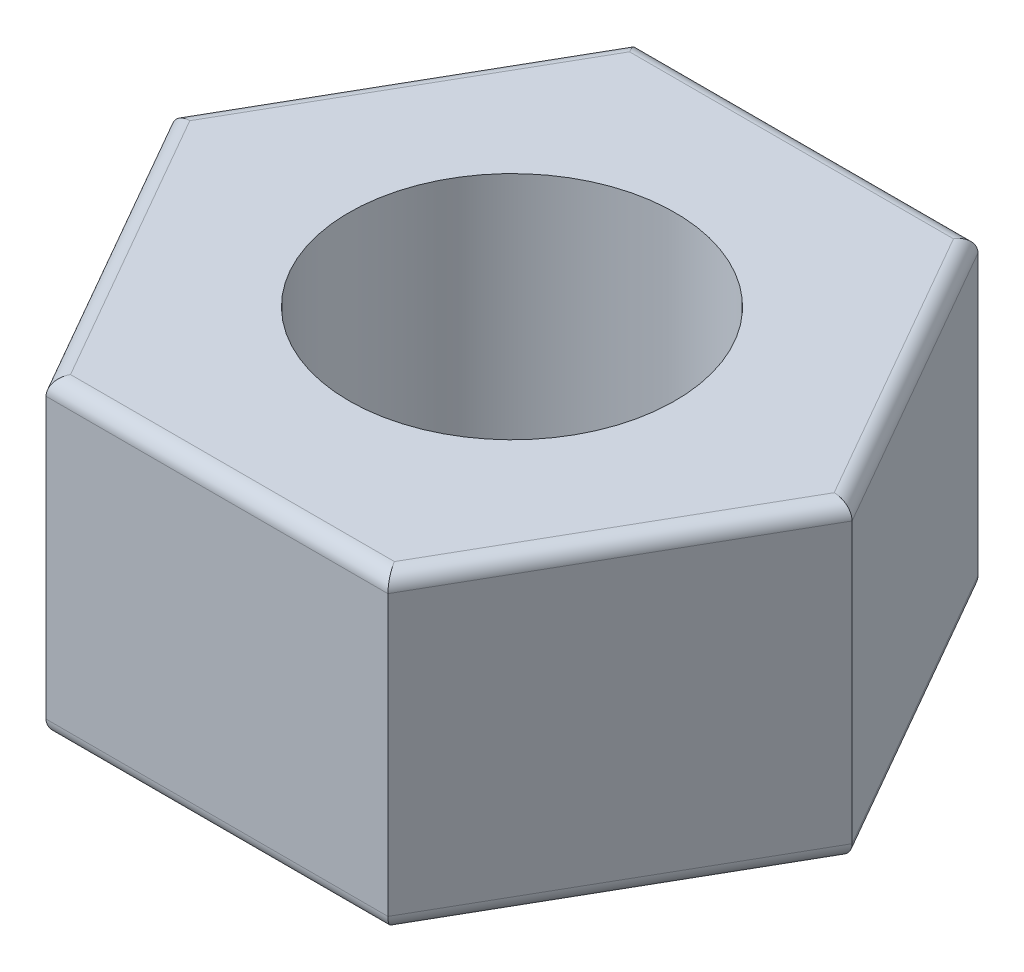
ISO-10303-21;
HEADER;
FILE_DESCRIPTION(('STEP AP214'),'2;1');
FILE_NAME('part.step','',(''),(''),'','','');
FILE_SCHEMA(('AUTOMOTIVE_DESIGN { 1 0 10303 214 1 1 1 1 }'));
ENDSEC;
DATA;
#1=APPLICATION_CONTEXT('core data for automotive mechanical design processes');
#2=APPLICATION_PROTOCOL_DEFINITION('international standard','automotive_design',2000,#1);
#3=PRODUCT_CONTEXT('',#1,'mechanical');
#4=PRODUCT('Part','Part','',(#3));
#5=PRODUCT_RELATED_PRODUCT_CATEGORY('part','',(#4));
#6=PRODUCT_DEFINITION_FORMATION('','',#4);
#7=PRODUCT_DEFINITION_CONTEXT('part definition',#1,'design');
#8=PRODUCT_DEFINITION('design','',#6,#7);
#9=PRODUCT_DEFINITION_SHAPE('','',#8);
#10=(LENGTH_UNIT() NAMED_UNIT(*) SI_UNIT(.MILLI.,.METRE.));
#11=(NAMED_UNIT(*) PLANE_ANGLE_UNIT() SI_UNIT($,.RADIAN.));
#12=(NAMED_UNIT(*) SI_UNIT($,.STERADIAN.) SOLID_ANGLE_UNIT());
#13=UNCERTAINTY_MEASURE_WITH_UNIT(LENGTH_MEASURE(1.E-05),#10,'distance_accuracy_value','');
#14=(GEOMETRIC_REPRESENTATION_CONTEXT(3) GLOBAL_UNCERTAINTY_ASSIGNED_CONTEXT((#13)) GLOBAL_UNIT_ASSIGNED_CONTEXT((#10,
#11,#12)) REPRESENTATION_CONTEXT('',''));
#15=CARTESIAN_POINT('',(0.,0.,0.));
#16=DIRECTION('',(0.,0.,1.));
#17=DIRECTION('',(1.,0.,0.));
#18=AXIS2_PLACEMENT_3D('',#15,#16,#17);
#19=CARTESIAN_POINT('',(5.50458908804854,10.,9.5));
#20=DIRECTION('',(0.,1.,0.));
#21=DIRECTION('',(0.,0.,1.));
#22=AXIS2_PLACEMENT_3D('',#19,#20,#21);
#23=PLANE('',#22);
#24=DIRECTION('',(-0.497297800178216,0.,0.867579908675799));
#25=VECTOR('',#24,1.);
#26=CARTESIAN_POINT('',(-10.5162100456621,10.,0.248648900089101));
#27=LINE('',#26,#25);
#28=CARTESIAN_POINT('',(-5.21487387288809,10.,-9.));
#29=VERTEX_POINT('',#28);
#30=CARTESIAN_POINT('',(-10.3736842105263,10.,0.));
#31=VERTEX_POINT('',#30);
#32=EDGE_CURVE('E38',#29,#31,#27,.T.);
#33=ORIENTED_EDGE('',*,*,#32,.T.);
#34=DIRECTION('',(0.497297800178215,0.,0.867579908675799));
#35=VECTOR('',#34,1.);
#36=CARTESIAN_POINT('',(-5.07079913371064,10.,9.25135109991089));
#37=LINE('',#36,#35);
#38=CARTESIAN_POINT('',(-5.21487387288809,10.,9.));
#39=VERTEX_POINT('',#38);
#40=EDGE_CURVE('E11',#31,#39,#37,.T.);
#41=ORIENTED_EDGE('',*,*,#40,.T.);
#42=DIRECTION('',(1.,0.,0.));
#43=VECTOR('',#42,1.);
#44=CARTESIAN_POINT('',(5.50458908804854,10.,9.));
#45=LINE('',#44,#43);
#46=CARTESIAN_POINT('',(5.21487387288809,10.,9.));
#47=VERTEX_POINT('',#46);
#48=EDGE_CURVE('E152',#39,#47,#45,.T.);
#49=ORIENTED_EDGE('',*,*,#48,.T.);
#50=DIRECTION('',(0.497297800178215,0.,-0.867579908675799));
#51=VECTOR('',#50,1.);
#52=CARTESIAN_POINT('',(10.5162100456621,10.,-0.248648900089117));
#53=LINE('',#52,#51);
#54=CARTESIAN_POINT('',(10.3736842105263,10.,0.));
#55=VERTEX_POINT('',#54);
#56=EDGE_CURVE('E230',#47,#55,#53,.T.);
#57=ORIENTED_EDGE('',*,*,#56,.T.);
#58=DIRECTION('',(-0.497297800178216,0.,-0.867579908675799));
#59=VECTOR('',#58,1.);
#60=CARTESIAN_POINT('',(5.07079913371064,10.,-9.25135109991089));
#61=LINE('',#60,#59);
#62=CARTESIAN_POINT('',(5.21487387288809,10.,-9.));
#63=VERTEX_POINT('',#62);
#64=EDGE_CURVE('E232',#55,#63,#61,.T.);
#65=ORIENTED_EDGE('',*,*,#64,.T.);
#66=DIRECTION('',(-1.,0.,0.));
#67=VECTOR('',#66,1.);
#68=CARTESIAN_POINT('',(-5.50458908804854,10.,-9.));
#69=LINE('',#68,#67);
#70=EDGE_CURVE('E48',#63,#29,#69,.T.);
#71=ORIENTED_EDGE('',*,*,#70,.T.);
#72=EDGE_LOOP('',(#33,#41,#49,#57,#65,#71));
#73=FACE_BOUND('',#72,.T.);
#74=CARTESIAN_POINT('',(0.,10.,0.));
#75=DIRECTION('',(0.,1.,0.));
#76=DIRECTION('',(0.,0.,1.));
#77=AXIS2_PLACEMENT_3D('',#74,#75,#76);
#78=CIRCLE('',#77,5.25);
#79=CARTESIAN_POINT('',(0.,10.,5.25));
#80=VERTEX_POINT('',#79);
#81=EDGE_CURVE('E141',#80,#80,#78,.T.);
#82=ORIENTED_EDGE('',*,*,#81,.F.);
#83=EDGE_LOOP('',(#82));
#84=FACE_BOUND('',#83,.T.);
#85=ADVANCED_FACE('F30',(#73,#84),#23,.T.);
#86=CARTESIAN_POINT('',(5.50458908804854,0.,9.5));
#87=DIRECTION('',(0.,1.,0.));
#88=DIRECTION('',(0.,0.,1.));
#89=AXIS2_PLACEMENT_3D('',#86,#87,#88);
#90=PLANE('',#89);
#91=DIRECTION('',(1.,0.,0.));
#92=VECTOR('',#91,1.);
#93=CARTESIAN_POINT('',(5.50458908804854,0.,9.));
#94=LINE('',#93,#92);
#95=CARTESIAN_POINT('',(5.21487387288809,0.,9.));
#96=VERTEX_POINT('',#95);
#97=CARTESIAN_POINT('',(-5.21487387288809,0.,9.));
#98=VERTEX_POINT('',#97);
#99=EDGE_CURVE('E200',#96,#98,#94,.F.);
#100=ORIENTED_EDGE('',*,*,#99,.T.);
#101=DIRECTION('',(0.497297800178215,0.,0.867579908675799));
#102=VECTOR('',#101,1.);
#103=CARTESIAN_POINT('',(-2.3481732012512,0.,14.0012123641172));
#104=LINE('',#103,#102);
#105=CARTESIAN_POINT('',(-10.3736842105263,0.,0.));
#106=VERTEX_POINT('',#105);
#107=EDGE_CURVE('E210',#98,#106,#104,.F.);
#108=ORIENTED_EDGE('',*,*,#107,.T.);
#109=DIRECTION('',(-0.497297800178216,0.,0.867579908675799));
#110=VECTOR('',#109,1.);
#111=CARTESIAN_POINT('',(-10.5456392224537,0.,0.299990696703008));
#112=LINE('',#111,#110);
#113=CARTESIAN_POINT('',(-5.21487387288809,0.,-9.));
#114=VERTEX_POINT('',#113);
#115=EDGE_CURVE('E208',#106,#114,#112,.F.);
#116=ORIENTED_EDGE('',*,*,#115,.T.);
#117=DIRECTION('',(-1.,0.,0.));
#118=VECTOR('',#117,1.);
#119=CARTESIAN_POINT('',(5.50458908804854,0.,-9.));
#120=LINE('',#119,#118);
#121=CARTESIAN_POINT('',(5.21487387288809,0.,-9.));
#122=VERTEX_POINT('',#121);
#123=EDGE_CURVE('E206',#114,#122,#120,.F.);
#124=ORIENTED_EDGE('',*,*,#123,.T.);
#125=DIRECTION('',(-0.497297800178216,0.,-0.867579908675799));
#126=VECTOR('',#125,1.);
#127=CARTESIAN_POINT('',(13.2682651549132,0.,5.04985196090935));
#128=LINE('',#127,#126);
#129=CARTESIAN_POINT('',(10.3736842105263,0.,0.));
#130=VERTEX_POINT('',#129);
#131=EDGE_CURVE('E204',#122,#130,#128,.F.);
#132=ORIENTED_EDGE('',*,*,#131,.T.);
#133=DIRECTION('',(0.497297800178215,0.,-0.867579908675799));
#134=VECTOR('',#133,1.);
#135=CARTESIAN_POINT('',(5.07079913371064,0.,9.25135109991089));
#136=LINE('',#135,#134);
#137=EDGE_CURVE('E202',#130,#96,#136,.F.);
#138=ORIENTED_EDGE('',*,*,#137,.T.);
#139=EDGE_LOOP('',(#100,#108,#116,#124,#132,#138));
#140=FACE_BOUND('',#139,.T.);
#141=CARTESIAN_POINT('',(0.,0.,0.));
#142=DIRECTION('',(0.,1.,0.));
#143=DIRECTION('',(0.,0.,1.));
#144=AXIS2_PLACEMENT_3D('',#141,#142,#143);
#145=CIRCLE('',#144,5.25);
#146=CARTESIAN_POINT('',(0.,0.,5.25));
#147=VERTEX_POINT('',#146);
#148=EDGE_CURVE('E183',#147,#147,#145,.T.);
#149=ORIENTED_EDGE('',*,*,#148,.T.);
#150=EDGE_LOOP('',(#149));
#151=FACE_BOUND('',#150,.T.);
#152=ADVANCED_FACE('F270',(#140,#151),#90,.F.);
#153=CARTESIAN_POINT('',(-5.50458908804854,10.,9.5));
#154=DIRECTION('',(0.,0.,-1.));
#155=DIRECTION('',(-1.,0.,0.));
#156=AXIS2_PLACEMENT_3D('',#153,#154,#155);
#157=PLANE('',#156);
#158=DIRECTION('',(0.,-1.,0.));
#159=VECTOR('',#158,1.);
#160=CARTESIAN_POINT('',(-5.50458908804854,10.,9.5));
#161=LINE('',#160,#159);
#162=CARTESIAN_POINT('',(-5.50458908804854,9.5,9.5));
#163=VERTEX_POINT('',#162);
#164=CARTESIAN_POINT('',(-5.50458908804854,0.499999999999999,9.5));
#165=VERTEX_POINT('',#164);
#166=EDGE_CURVE('E120',#163,#165,#161,.T.);
#167=ORIENTED_EDGE('',*,*,#166,.T.);
#168=DIRECTION('',(1.,0.,0.));
#169=VECTOR('',#168,1.);
#170=CARTESIAN_POINT('',(-5.50458908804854,0.5,9.5));
#171=LINE('',#170,#169);
#172=CARTESIAN_POINT('',(5.50458908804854,0.5,9.5));
#173=VERTEX_POINT('',#172);
#174=EDGE_CURVE('E127',#165,#173,#171,.T.);
#175=ORIENTED_EDGE('',*,*,#174,.T.);
#176=DIRECTION('',(0.,-1.,0.));
#177=VECTOR('',#176,1.);
#178=CARTESIAN_POINT('',(5.50458908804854,10.,9.5));
#179=LINE('',#178,#177);
#180=CARTESIAN_POINT('',(5.50458908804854,9.5,9.5));
#181=VERTEX_POINT('',#180);
#182=EDGE_CURVE('E122',#181,#173,#179,.T.);
#183=ORIENTED_EDGE('',*,*,#182,.F.);
#184=DIRECTION('',(1.,0.,0.));
#185=VECTOR('',#184,1.);
#186=CARTESIAN_POINT('',(-5.50458908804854,9.5,9.5));
#187=LINE('',#186,#185);
#188=EDGE_CURVE('E118',#181,#163,#187,.F.);
#189=ORIENTED_EDGE('',*,*,#188,.T.);
#190=EDGE_LOOP('',(#167,#175,#183,#189));
#191=FACE_BOUND('',#190,.T.);
#192=ADVANCED_FACE('F32',(#191),#157,.F.);
#193=CARTESIAN_POINT('',(5.50458908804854,10.,9.5));
#194=DIRECTION('',(-0.867579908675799,0.,-0.497297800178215));
#195=DIRECTION('',(-0.497297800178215,0.,0.867579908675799));
#196=AXIS2_PLACEMENT_3D('',#193,#194,#195);
#197=PLANE('',#196);
#198=ORIENTED_EDGE('',*,*,#182,.T.);
#199=DIRECTION('',(0.497297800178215,0.,-0.867579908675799));
#200=VECTOR('',#199,1.);
#201=CARTESIAN_POINT('',(5.50458908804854,0.5,9.5));
#202=LINE('',#201,#200);
#203=CARTESIAN_POINT('',(10.95,0.5,0.));
#204=VERTEX_POINT('',#203);
#205=EDGE_CURVE('E128',#173,#204,#202,.T.);
#206=ORIENTED_EDGE('',*,*,#205,.T.);
#207=DIRECTION('',(0.,-1.,0.));
#208=VECTOR('',#207,1.);
#209=CARTESIAN_POINT('',(10.95,10.,0.));
#210=LINE('',#209,#208);
#211=CARTESIAN_POINT('',(10.95,9.5,0.));
#212=VERTEX_POINT('',#211);
#213=EDGE_CURVE('E195',#212,#204,#210,.T.);
#214=ORIENTED_EDGE('',*,*,#213,.F.);
#215=DIRECTION('',(0.497297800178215,0.,-0.867579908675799));
#216=VECTOR('',#215,1.);
#217=CARTESIAN_POINT('',(5.50458908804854,9.5,9.5));
#218=LINE('',#217,#216);
#219=EDGE_CURVE('E225',#212,#181,#218,.F.);
#220=ORIENTED_EDGE('',*,*,#219,.T.);
#221=EDGE_LOOP('',(#198,#206,#214,#220));
#222=FACE_BOUND('',#221,.T.);
#223=ADVANCED_FACE('F252',(#222),#197,.F.);
#224=CARTESIAN_POINT('',(5.50458908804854,10.,-9.5));
#225=DIRECTION('',(-0.867579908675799,0.,0.497297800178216));
#226=DIRECTION('',(0.497297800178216,0.,0.867579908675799));
#227=AXIS2_PLACEMENT_3D('',#224,#225,#226);
#228=PLANE('',#227);
#229=ORIENTED_EDGE('',*,*,#213,.T.);
#230=DIRECTION('',(-0.497297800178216,0.,-0.867579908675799));
#231=VECTOR('',#230,1.);
#232=CARTESIAN_POINT('',(5.50458908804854,0.5,-9.5));
#233=LINE('',#232,#231);
#234=CARTESIAN_POINT('',(5.50458908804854,0.5,-9.5));
#235=VERTEX_POINT('',#234);
#236=EDGE_CURVE('E223',#204,#235,#233,.T.);
#237=ORIENTED_EDGE('',*,*,#236,.T.);
#238=DIRECTION('',(0.,-1.,0.));
#239=VECTOR('',#238,1.);
#240=CARTESIAN_POINT('',(5.50458908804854,10.,-9.5));
#241=LINE('',#240,#239);
#242=CARTESIAN_POINT('',(5.50458908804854,9.5,-9.5));
#243=VERTEX_POINT('',#242);
#244=EDGE_CURVE('E192',#243,#235,#241,.T.);
#245=ORIENTED_EDGE('',*,*,#244,.F.);
#246=DIRECTION('',(-0.497297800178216,0.,-0.867579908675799));
#247=VECTOR('',#246,1.);
#248=CARTESIAN_POINT('',(10.95,9.5,0.));
#249=LINE('',#248,#247);
#250=EDGE_CURVE('E221',#243,#212,#249,.F.);
#251=ORIENTED_EDGE('',*,*,#250,.T.);
#252=EDGE_LOOP('',(#229,#237,#245,#251));
#253=FACE_BOUND('',#252,.T.);
#254=ADVANCED_FACE('F256',(#253),#228,.F.);
#255=CARTESIAN_POINT('',(-5.50458908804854,10.,-9.5));
#256=DIRECTION('',(0.,0.,1.));
#257=DIRECTION('',(1.,0.,0.));
#258=AXIS2_PLACEMENT_3D('',#255,#256,#257);
#259=PLANE('',#258);
#260=ORIENTED_EDGE('',*,*,#244,.T.);
#261=DIRECTION('',(-1.,0.,0.));
#262=VECTOR('',#261,1.);
#263=CARTESIAN_POINT('',(-5.50458908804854,0.5,-9.5));
#264=LINE('',#263,#262);
#265=CARTESIAN_POINT('',(-5.50458908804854,0.5,-9.5));
#266=VERTEX_POINT('',#265);
#267=EDGE_CURVE('E219',#235,#266,#264,.T.);
#268=ORIENTED_EDGE('',*,*,#267,.T.);
#269=DIRECTION('',(0.,-1.,0.));
#270=VECTOR('',#269,1.);
#271=CARTESIAN_POINT('',(-5.50458908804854,10.,-9.5));
#272=LINE('',#271,#270);
#273=CARTESIAN_POINT('',(-5.50458908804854,9.5,-9.5));
#274=VERTEX_POINT('',#273);
#275=EDGE_CURVE('E189',#274,#266,#272,.T.);
#276=ORIENTED_EDGE('',*,*,#275,.F.);
#277=DIRECTION('',(-1.,0.,0.));
#278=VECTOR('',#277,1.);
#279=CARTESIAN_POINT('',(5.50458908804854,9.5,-9.5));
#280=LINE('',#279,#278);
#281=EDGE_CURVE('E217',#274,#243,#280,.F.);
#282=ORIENTED_EDGE('',*,*,#281,.T.);
#283=EDGE_LOOP('',(#260,#268,#276,#282));
#284=FACE_BOUND('',#283,.T.);
#285=ADVANCED_FACE('F280',(#284),#259,.F.);
#286=CARTESIAN_POINT('',(-5.50458908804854,10.,-9.5));
#287=DIRECTION('',(0.867579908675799,0.,0.497297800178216));
#288=DIRECTION('',(0.497297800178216,0.,-0.867579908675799));
#289=AXIS2_PLACEMENT_3D('',#286,#287,#288);
#290=PLANE('',#289);
#291=ORIENTED_EDGE('',*,*,#275,.T.);
#292=DIRECTION('',(-0.497297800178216,0.,0.867579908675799));
#293=VECTOR('',#292,1.);
#294=CARTESIAN_POINT('',(-5.50458908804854,0.5,-9.5));
#295=LINE('',#294,#293);
#296=CARTESIAN_POINT('',(-10.95,0.5,0.));
#297=VERTEX_POINT('',#296);
#298=EDGE_CURVE('E215',#266,#297,#295,.T.);
#299=ORIENTED_EDGE('',*,*,#298,.T.);
#300=DIRECTION('',(0.,-1.,0.));
#301=VECTOR('',#300,1.);
#302=CARTESIAN_POINT('',(-10.95,10.,0.));
#303=LINE('',#302,#301);
#304=CARTESIAN_POINT('',(-10.95,9.5,0.));
#305=VERTEX_POINT('',#304);
#306=EDGE_CURVE('E140',#305,#297,#303,.T.);
#307=ORIENTED_EDGE('',*,*,#306,.F.);
#308=DIRECTION('',(-0.497297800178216,0.,0.867579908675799));
#309=VECTOR('',#308,1.);
#310=CARTESIAN_POINT('',(-5.50458908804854,9.5,-9.5));
#311=LINE('',#310,#309);
#312=EDGE_CURVE('E213',#305,#274,#311,.F.);
#313=ORIENTED_EDGE('',*,*,#312,.T.);
#314=EDGE_LOOP('',(#291,#299,#307,#313));
#315=FACE_BOUND('',#314,.T.);
#316=ADVANCED_FACE('F282',(#315),#290,.F.);
#317=CARTESIAN_POINT('',(-5.50458908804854,10.,9.5));
#318=DIRECTION('',(0.867579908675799,0.,-0.497297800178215));
#319=DIRECTION('',(-0.497297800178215,0.,-0.867579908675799));
#320=AXIS2_PLACEMENT_3D('',#317,#318,#319);
#321=PLANE('',#320);
#322=ORIENTED_EDGE('',*,*,#306,.T.);
#323=DIRECTION('',(0.497297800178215,0.,0.867579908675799));
#324=VECTOR('',#323,1.);
#325=CARTESIAN_POINT('',(-5.50458908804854,0.5,9.5));
#326=LINE('',#325,#324);
#327=EDGE_CURVE('E139',#297,#165,#326,.T.);
#328=ORIENTED_EDGE('',*,*,#327,.T.);
#329=ORIENTED_EDGE('',*,*,#166,.F.);
#330=DIRECTION('',(0.497297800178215,0.,0.867579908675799));
#331=VECTOR('',#330,1.);
#332=CARTESIAN_POINT('',(-10.95,9.5,0.));
#333=LINE('',#332,#331);
#334=EDGE_CURVE('E136',#163,#305,#333,.F.);
#335=ORIENTED_EDGE('',*,*,#334,.T.);
#336=EDGE_LOOP('',(#322,#328,#329,#335));
#337=FACE_BOUND('',#336,.T.);
#338=ADVANCED_FACE('F135',(#337),#321,.F.);
#339=CARTESIAN_POINT('',(0.,10.,0.));
#340=DIRECTION('',(0.,-1.,0.));
#341=DIRECTION('',(0.,0.,-1.));
#342=AXIS2_PLACEMENT_3D('',#339,#340,#341);
#343=CYLINDRICAL_SURFACE('',#342,5.25);
#344=ORIENTED_EDGE('',*,*,#81,.T.);
#345=EDGE_LOOP('',(#344));
#346=FACE_BOUND('',#345,.T.);
#347=ORIENTED_EDGE('',*,*,#148,.F.);
#348=EDGE_LOOP('',(#347));
#349=FACE_BOUND('',#348,.T.);
#350=ADVANCED_FACE('F311',(#346,#349),#343,.F.);
#351=CARTESIAN_POINT('',(5.07079913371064,0.5,-9.25135109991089));
#352=DIRECTION('',(-0.497297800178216,0.,-0.867579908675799));
#353=DIRECTION('',(-0.867579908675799,0.,0.497297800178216));
#354=AXIS2_PLACEMENT_3D('',#351,#352,#353);
#355=CYLINDRICAL_SURFACE('',#354,0.5);
#356=CARTESIAN_POINT('',(10.3736842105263,0.5,0.));
#357=DIRECTION('',(0.,0.,-1.));
#358=DIRECTION('',(1.,0.,0.));
#359=AXIS2_PLACEMENT_3D('',#356,#357,#358);
#360=ELLIPSE('',#359,0.576315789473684,0.5);
#361=EDGE_CURVE('E177',#130,#204,#360,.F.);
#362=ORIENTED_EDGE('',*,*,#361,.F.);
#363=ORIENTED_EDGE('',*,*,#131,.F.);
#364=CARTESIAN_POINT('',(5.21487387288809,0.5,-9.));
#365=DIRECTION('',(-0.865244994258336,0.,-0.501349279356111));
#366=DIRECTION('',(0.501349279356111,0.,-0.865244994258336));
#367=AXIS2_PLACEMENT_3D('',#364,#365,#366);
#368=ELLIPSE('',#367,0.57787101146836,0.5);
#369=EDGE_CURVE('E180',#235,#122,#368,.T.);
#370=ORIENTED_EDGE('',*,*,#369,.F.);
#371=ORIENTED_EDGE('',*,*,#236,.F.);
#372=EDGE_LOOP('',(#362,#363,#370,#371));
#373=FACE_BOUND('',#372,.T.);
#374=ADVANCED_FACE('F261',(#373),#355,.T.);
#375=CARTESIAN_POINT('',(-5.50458908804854,0.5,-9.));
#376=DIRECTION('',(-1.,0.,0.));
#377=DIRECTION('',(0.,0.,1.));
#378=AXIS2_PLACEMENT_3D('',#375,#376,#377);
#379=CYLINDRICAL_SURFACE('',#378,0.5);
#380=ORIENTED_EDGE('',*,*,#369,.T.);
#381=ORIENTED_EDGE('',*,*,#123,.F.);
#382=CARTESIAN_POINT('',(-5.21487387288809,0.5,-9.));
#383=DIRECTION('',(-0.865244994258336,0.,0.501349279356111));
#384=DIRECTION('',(-0.501349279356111,0.,-0.865244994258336));
#385=AXIS2_PLACEMENT_3D('',#382,#383,#384);
#386=ELLIPSE('',#385,0.57787101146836,0.5);
#387=EDGE_CURVE('E174',#266,#114,#386,.T.);
#388=ORIENTED_EDGE('',*,*,#387,.F.);
#389=ORIENTED_EDGE('',*,*,#267,.F.);
#390=EDGE_LOOP('',(#380,#381,#388,#389));
#391=FACE_BOUND('',#390,.T.);
#392=ADVANCED_FACE('F275',(#391),#379,.T.);
#393=CARTESIAN_POINT('',(5.07079913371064,0.5,9.25135109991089));
#394=DIRECTION('',(0.497297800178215,0.,-0.867579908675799));
#395=DIRECTION('',(-0.867579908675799,0.,-0.497297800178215));
#396=AXIS2_PLACEMENT_3D('',#393,#394,#395);
#397=CYLINDRICAL_SURFACE('',#396,0.5);
#398=ORIENTED_EDGE('',*,*,#361,.T.);
#399=ORIENTED_EDGE('',*,*,#205,.F.);
#400=CARTESIAN_POINT('',(5.21487387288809,0.5,9.));
#401=DIRECTION('',(0.865244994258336,0.,-0.501349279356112));
#402=DIRECTION('',(0.501349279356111,0.,0.865244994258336));
#403=AXIS2_PLACEMENT_3D('',#400,#401,#402);
#404=ELLIPSE('',#403,0.57787101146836,0.5);
#405=EDGE_CURVE('E171',#96,#173,#404,.F.);
#406=ORIENTED_EDGE('',*,*,#405,.F.);
#407=ORIENTED_EDGE('',*,*,#137,.F.);
#408=EDGE_LOOP('',(#398,#399,#406,#407));
#409=FACE_BOUND('',#408,.T.);
#410=ADVANCED_FACE('F266',(#409),#397,.T.);
#411=CARTESIAN_POINT('',(-5.07079913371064,0.5,-9.25135109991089));
#412=DIRECTION('',(-0.497297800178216,0.,0.867579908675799));
#413=DIRECTION('',(0.867579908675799,0.,0.497297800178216));
#414=AXIS2_PLACEMENT_3D('',#411,#412,#413);
#415=CYLINDRICAL_SURFACE('',#414,0.5);
#416=ORIENTED_EDGE('',*,*,#387,.T.);
#417=ORIENTED_EDGE('',*,*,#115,.F.);
#418=CARTESIAN_POINT('',(-10.3736842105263,0.5,0.));
#419=DIRECTION('',(0.,0.,1.));
#420=DIRECTION('',(-1.,0.,0.));
#421=AXIS2_PLACEMENT_3D('',#418,#419,#420);
#422=ELLIPSE('',#421,0.576315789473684,0.5);
#423=EDGE_CURVE('E169',#297,#106,#422,.T.);
#424=ORIENTED_EDGE('',*,*,#423,.F.);
#425=ORIENTED_EDGE('',*,*,#298,.F.);
#426=EDGE_LOOP('',(#416,#417,#424,#425));
#427=FACE_BOUND('',#426,.T.);
#428=ADVANCED_FACE('F286',(#427),#415,.T.);
#429=CARTESIAN_POINT('',(-5.50458908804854,0.5,9.));
#430=DIRECTION('',(1.,0.,0.));
#431=DIRECTION('',(0.,0.,-1.));
#432=AXIS2_PLACEMENT_3D('',#429,#430,#431);
#433=CYLINDRICAL_SURFACE('',#432,0.5);
#434=ORIENTED_EDGE('',*,*,#405,.T.);
#435=ORIENTED_EDGE('',*,*,#174,.F.);
#436=CARTESIAN_POINT('',(-5.21487387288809,0.5,9.));
#437=DIRECTION('',(0.865244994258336,0.,0.501349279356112));
#438=DIRECTION('',(0.501349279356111,0.,-0.865244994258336));
#439=AXIS2_PLACEMENT_3D('',#436,#437,#438);
#440=ELLIPSE('',#439,0.57787101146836,0.5);
#441=EDGE_CURVE('E167',#98,#165,#440,.F.);
#442=ORIENTED_EDGE('',*,*,#441,.F.);
#443=ORIENTED_EDGE('',*,*,#99,.F.);
#444=EDGE_LOOP('',(#434,#435,#442,#443));
#445=FACE_BOUND('',#444,.T.);
#446=ADVANCED_FACE('F292',(#445),#433,.T.);
#447=CARTESIAN_POINT('',(-5.07079913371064,0.5,9.25135109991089));
#448=DIRECTION('',(0.497297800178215,0.,0.867579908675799));
#449=DIRECTION('',(0.867579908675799,0.,-0.497297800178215));
#450=AXIS2_PLACEMENT_3D('',#447,#448,#449);
#451=CYLINDRICAL_SURFACE('',#450,0.5);
#452=ORIENTED_EDGE('',*,*,#423,.T.);
#453=ORIENTED_EDGE('',*,*,#107,.F.);
#454=ORIENTED_EDGE('',*,*,#441,.T.);
#455=ORIENTED_EDGE('',*,*,#327,.F.);
#456=EDGE_LOOP('',(#452,#453,#454,#455));
#457=FACE_BOUND('',#456,.T.);
#458=ADVANCED_FACE('F288',(#457),#451,.T.);
#459=CARTESIAN_POINT('',(13.2682651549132,9.5,5.04985196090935));
#460=DIRECTION('',(0.497297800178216,0.,0.867579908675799));
#461=DIRECTION('',(0.867579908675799,0.,-0.497297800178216));
#462=AXIS2_PLACEMENT_3D('',#459,#460,#461);
#463=CYLINDRICAL_SURFACE('',#462,0.5);
#464=CARTESIAN_POINT('',(10.3736842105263,9.5,0.));
#465=DIRECTION('',(0.,0.,1.));
#466=DIRECTION('',(-1.,0.,0.));
#467=AXIS2_PLACEMENT_3D('',#464,#465,#466);
#468=ELLIPSE('',#467,0.576315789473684,0.5);
#469=EDGE_CURVE('E161',#212,#55,#468,.T.);
#470=ORIENTED_EDGE('',*,*,#469,.F.);
#471=ORIENTED_EDGE('',*,*,#250,.F.);
#472=CARTESIAN_POINT('',(5.21487387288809,9.5,-9.));
#473=DIRECTION('',(0.865244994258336,0.,0.501349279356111));
#474=DIRECTION('',(-0.501349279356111,0.,0.865244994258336));
#475=AXIS2_PLACEMENT_3D('',#472,#473,#474);
#476=ELLIPSE('',#475,0.57787101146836,0.5);
#477=EDGE_CURVE('E164',#63,#243,#476,.F.);
#478=ORIENTED_EDGE('',*,*,#477,.F.);
#479=ORIENTED_EDGE('',*,*,#64,.F.);
#480=EDGE_LOOP('',(#470,#471,#478,#479));
#481=FACE_BOUND('',#480,.T.);
#482=ADVANCED_FACE('F241',(#481),#463,.T.);
#483=CARTESIAN_POINT('',(5.50458908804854,9.5,-9.));
#484=DIRECTION('',(1.,0.,0.));
#485=DIRECTION('',(0.,0.,-1.));
#486=AXIS2_PLACEMENT_3D('',#483,#484,#485);
#487=CYLINDRICAL_SURFACE('',#486,0.5);
#488=ORIENTED_EDGE('',*,*,#477,.T.);
#489=ORIENTED_EDGE('',*,*,#281,.F.);
#490=CARTESIAN_POINT('',(-5.21487387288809,9.5,-9.));
#491=DIRECTION('',(0.865244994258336,0.,-0.501349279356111));
#492=DIRECTION('',(0.501349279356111,0.,0.865244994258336));
#493=AXIS2_PLACEMENT_3D('',#490,#491,#492);
#494=ELLIPSE('',#493,0.57787101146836,0.5);
#495=EDGE_CURVE('E158',#29,#274,#494,.F.);
#496=ORIENTED_EDGE('',*,*,#495,.F.);
#497=ORIENTED_EDGE('',*,*,#70,.F.);
#498=EDGE_LOOP('',(#488,#489,#496,#497));
#499=FACE_BOUND('',#498,.T.);
#500=ADVANCED_FACE('F244',(#499),#487,.T.);
#501=CARTESIAN_POINT('',(5.07079913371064,9.5,9.25135109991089));
#502=DIRECTION('',(-0.497297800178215,0.,0.867579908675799));
#503=DIRECTION('',(0.867579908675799,0.,0.497297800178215));
#504=AXIS2_PLACEMENT_3D('',#501,#502,#503);
#505=CYLINDRICAL_SURFACE('',#504,0.5);
#506=ORIENTED_EDGE('',*,*,#469,.T.);
#507=ORIENTED_EDGE('',*,*,#56,.F.);
#508=CARTESIAN_POINT('',(5.21487387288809,9.5,9.));
#509=DIRECTION('',(-0.865244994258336,0.,0.501349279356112));
#510=DIRECTION('',(-0.501349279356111,0.,-0.865244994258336));
#511=AXIS2_PLACEMENT_3D('',#508,#509,#510);
#512=ELLIPSE('',#511,0.57787101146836,0.5);
#513=EDGE_CURVE('E154',#181,#47,#512,.T.);
#514=ORIENTED_EDGE('',*,*,#513,.F.);
#515=ORIENTED_EDGE('',*,*,#219,.F.);
#516=EDGE_LOOP('',(#506,#507,#514,#515));
#517=FACE_BOUND('',#516,.T.);
#518=ADVANCED_FACE('F248',(#517),#505,.T.);
#519=CARTESIAN_POINT('',(-10.5456392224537,9.5,0.299990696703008));
#520=DIRECTION('',(0.497297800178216,0.,-0.867579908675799));
#521=DIRECTION('',(-0.867579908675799,0.,-0.497297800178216));
#522=AXIS2_PLACEMENT_3D('',#519,#520,#521);
#523=CYLINDRICAL_SURFACE('',#522,0.5);
#524=ORIENTED_EDGE('',*,*,#495,.T.);
#525=ORIENTED_EDGE('',*,*,#312,.F.);
#526=CARTESIAN_POINT('',(-10.3736842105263,9.5,0.));
#527=DIRECTION('',(0.,0.,-1.));
#528=DIRECTION('',(1.,0.,0.));
#529=AXIS2_PLACEMENT_3D('',#526,#527,#528);
#530=ELLIPSE('',#529,0.576315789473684,0.5);
#531=EDGE_CURVE('E148',#31,#305,#530,.F.);
#532=ORIENTED_EDGE('',*,*,#531,.F.);
#533=ORIENTED_EDGE('',*,*,#32,.F.);
#534=EDGE_LOOP('',(#524,#525,#532,#533));
#535=FACE_BOUND('',#534,.T.);
#536=ADVANCED_FACE('F246',(#535),#523,.T.);
#537=CARTESIAN_POINT('',(5.50458908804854,9.5,9.));
#538=DIRECTION('',(-1.,0.,0.));
#539=DIRECTION('',(0.,0.,1.));
#540=AXIS2_PLACEMENT_3D('',#537,#538,#539);
#541=CYLINDRICAL_SURFACE('',#540,0.5);
#542=ORIENTED_EDGE('',*,*,#513,.T.);
#543=ORIENTED_EDGE('',*,*,#48,.F.);
#544=CARTESIAN_POINT('',(-5.21487387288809,9.5,9.));
#545=DIRECTION('',(-0.865244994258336,0.,-0.501349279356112));
#546=DIRECTION('',(-0.501349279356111,0.,0.865244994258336));
#547=AXIS2_PLACEMENT_3D('',#544,#545,#546);
#548=ELLIPSE('',#547,0.57787101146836,0.5);
#549=EDGE_CURVE('E146',#163,#39,#548,.T.);
#550=ORIENTED_EDGE('',*,*,#549,.F.);
#551=ORIENTED_EDGE('',*,*,#188,.F.);
#552=EDGE_LOOP('',(#542,#543,#550,#551));
#553=FACE_BOUND('',#552,.T.);
#554=ADVANCED_FACE('F151',(#553),#541,.T.);
#555=CARTESIAN_POINT('',(-2.34817320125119,9.5,14.0012123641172));
#556=DIRECTION('',(-0.497297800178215,0.,-0.867579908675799));
#557=DIRECTION('',(-0.867579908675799,0.,0.497297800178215));
#558=AXIS2_PLACEMENT_3D('',#555,#556,#557);
#559=CYLINDRICAL_SURFACE('',#558,0.5);
#560=ORIENTED_EDGE('',*,*,#531,.T.);
#561=ORIENTED_EDGE('',*,*,#334,.F.);
#562=ORIENTED_EDGE('',*,*,#549,.T.);
#563=ORIENTED_EDGE('',*,*,#40,.F.);
#564=EDGE_LOOP('',(#560,#561,#562,#563));
#565=FACE_BOUND('',#564,.T.);
#566=ADVANCED_FACE('F144',(#565),#559,.T.);
#567=CLOSED_SHELL('',(#85,#152,#192,#223,#254,#285,#316,#338,#350,#374,#392,#410,#428,#446,#458,
#482,#500,#518,#536,#554,#566));
#568=MANIFOLD_SOLID_BREP('B2',#567);
#569=ADVANCED_BREP_SHAPE_REPRESENTATION('',(#18,#568),#14);
#570=SHAPE_DEFINITION_REPRESENTATION(#9,#569);
ENDSEC;
END-ISO-10303-21;
